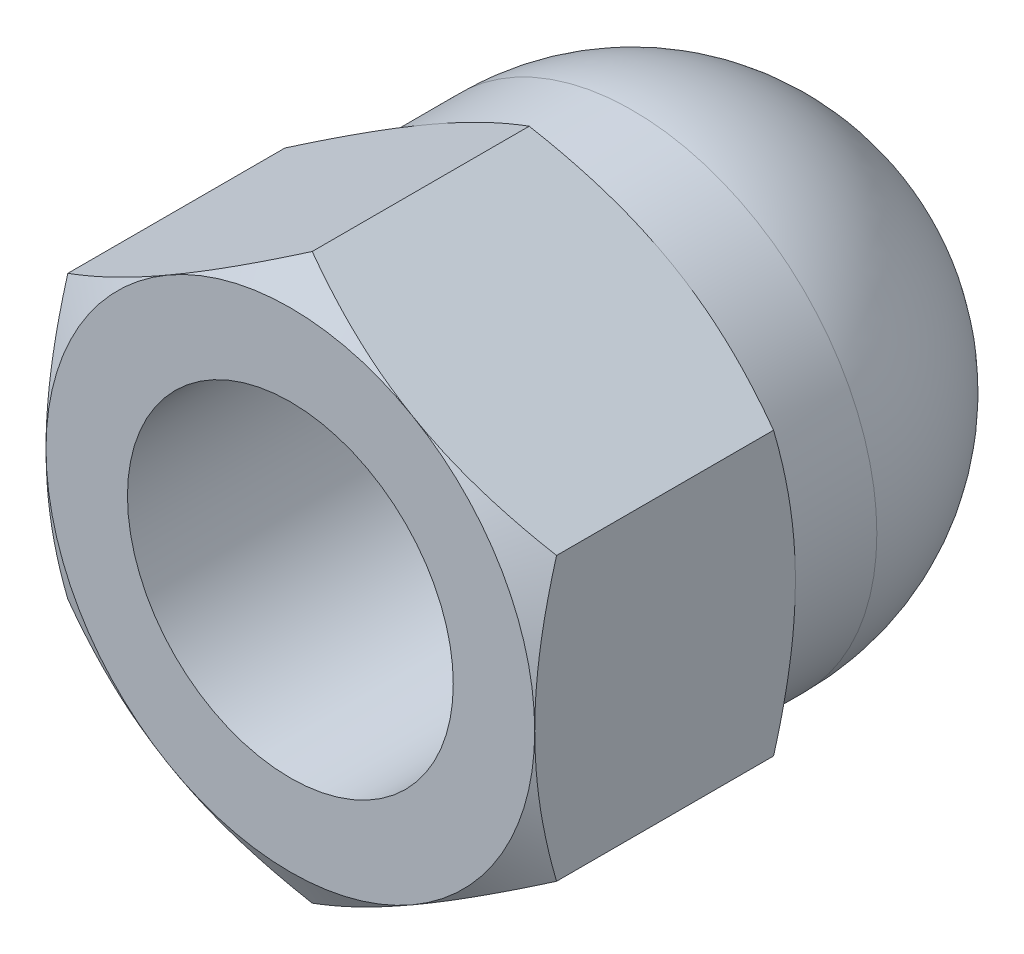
ISO-10303-21;
HEADER;
FILE_DESCRIPTION(('STEP AP214'),'2;1');
FILE_NAME('part.step','',(''),(''),'','','');
FILE_SCHEMA(('AUTOMOTIVE_DESIGN { 1 0 10303 214 1 1 1 1 }'));
ENDSEC;
DATA;
#1=APPLICATION_CONTEXT('core data for automotive mechanical design processes');
#2=APPLICATION_PROTOCOL_DEFINITION('international standard','automotive_design',2000,#1);
#3=PRODUCT_CONTEXT('',#1,'mechanical');
#4=PRODUCT('Part','Part','',(#3));
#5=PRODUCT_RELATED_PRODUCT_CATEGORY('part','',(#4));
#6=PRODUCT_DEFINITION_FORMATION('','',#4);
#7=PRODUCT_DEFINITION_CONTEXT('part definition',#1,'design');
#8=PRODUCT_DEFINITION('design','',#6,#7);
#9=PRODUCT_DEFINITION_SHAPE('','',#8);
#10=(LENGTH_UNIT() NAMED_UNIT(*) SI_UNIT(.MILLI.,.METRE.));
#11=(NAMED_UNIT(*) PLANE_ANGLE_UNIT() SI_UNIT($,.RADIAN.));
#12=(NAMED_UNIT(*) SI_UNIT($,.STERADIAN.) SOLID_ANGLE_UNIT());
#13=UNCERTAINTY_MEASURE_WITH_UNIT(LENGTH_MEASURE(1.E-05),#10,'distance_accuracy_value','');
#14=(GEOMETRIC_REPRESENTATION_CONTEXT(3) GLOBAL_UNCERTAINTY_ASSIGNED_CONTEXT((#13)) GLOBAL_UNIT_ASSIGNED_CONTEXT((#10,
#11,#12)) REPRESENTATION_CONTEXT('',''));
#15=CARTESIAN_POINT('',(0.,0.,0.));
#16=DIRECTION('',(0.,0.,1.));
#17=DIRECTION('',(1.,0.,0.));
#18=AXIS2_PLACEMENT_3D('',#15,#16,#17);
#19=CARTESIAN_POINT('',(-15.,25.9807621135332,0.));
#20=DIRECTION('',(0.,0.,-1.));
#21=DIRECTION('',(-1.,0.,0.));
#22=AXIS2_PLACEMENT_3D('',#19,#20,#21);
#23=PLANE('',#22);
#24=CARTESIAN_POINT('',(0.,0.,0.));
#25=DIRECTION('',(0.,0.,1.));
#26=DIRECTION('',(1.,0.,0.));
#27=AXIS2_PLACEMENT_3D('',#24,#25,#26);
#28=CIRCLE('',#27,10.);
#29=CARTESIAN_POINT('',(10.,0.,0.));
#30=VERTEX_POINT('',#29);
#31=EDGE_CURVE('E341',#30,#30,#28,.T.);
#32=ORIENTED_EDGE('',*,*,#31,.F.);
#33=EDGE_LOOP('',(#32));
#34=FACE_BOUND('',#33,.T.);
#35=CARTESIAN_POINT('',(0.,0.,0.));
#36=DIRECTION('',(0.,0.,-1.));
#37=DIRECTION('',(-1.,0.,0.));
#38=AXIS2_PLACEMENT_3D('',#35,#36,#37);
#39=CIRCLE('',#38,15.);
#40=CARTESIAN_POINT('',(-15.,0.,0.));
#41=VERTEX_POINT('',#40);
#42=CARTESIAN_POINT('',(-7.5,12.9903810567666,0.));
#43=VERTEX_POINT('',#42);
#44=EDGE_CURVE('E156',#41,#43,#39,.T.);
#45=ORIENTED_EDGE('',*,*,#44,.F.);
#46=CARTESIAN_POINT('',(0.,0.,0.));
#47=DIRECTION('',(0.,0.,-1.));
#48=DIRECTION('',(-1.,0.,0.));
#49=AXIS2_PLACEMENT_3D('',#46,#47,#48);
#50=CIRCLE('',#49,15.);
#51=CARTESIAN_POINT('',(-7.49999999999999,-12.9903810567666,0.));
#52=VERTEX_POINT('',#51);
#53=EDGE_CURVE('E145',#41,#52,#50,.F.);
#54=ORIENTED_EDGE('',*,*,#53,.T.);
#55=CARTESIAN_POINT('',(7.49999999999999,-12.9903810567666,0.));
#56=VERTEX_POINT('',#55);
#57=EDGE_CURVE('E261',#52,#56,#50,.F.);
#58=ORIENTED_EDGE('',*,*,#57,.T.);
#59=CARTESIAN_POINT('',(15.,0.,0.));
#60=VERTEX_POINT('',#59);
#61=EDGE_CURVE('E266',#56,#60,#50,.F.);
#62=ORIENTED_EDGE('',*,*,#61,.T.);
#63=CARTESIAN_POINT('',(7.49999999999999,12.9903810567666,0.));
#64=VERTEX_POINT('',#63);
#65=EDGE_CURVE('E267',#60,#64,#50,.F.);
#66=ORIENTED_EDGE('',*,*,#65,.T.);
#67=EDGE_CURVE('E248',#64,#43,#50,.F.);
#68=ORIENTED_EDGE('',*,*,#67,.T.);
#69=EDGE_LOOP('',(#45,#54,#58,#62,#66,#68));
#70=FACE_BOUND('',#69,.T.);
#71=ADVANCED_FACE('F32',(#34,#70),#23,.F.);
#72=CARTESIAN_POINT('',(0.,0.,0.));
#73=DIRECTION('',(0.,0.,-1.));
#74=DIRECTION('',(-1.,0.,0.));
#75=AXIS2_PLACEMENT_3D('',#72,#73,#74);
#76=CONICAL_SURFACE('',#75,15.,1.0471975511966);
#77=CARTESIAN_POINT('',(-15.,-23.3393093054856,-7.3576875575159));
#78=CARTESIAN_POINT('',(-15.,-23.0113763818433,-7.19841663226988));
#79=CARTESIAN_POINT('',(-15.,-22.6830606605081,-7.0399342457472));
#80=CARTESIAN_POINT('',(-15.,-22.0255837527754,-6.72472501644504));
#81=CARTESIAN_POINT('',(-15.,-21.6964225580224,-6.56799819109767));
#82=CARTESIAN_POINT('',(-15.,-20.7074642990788,-6.10067791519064));
#83=CARTESIAN_POINT('',(-15.,-20.0462884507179,-5.79299136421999));
#84=CARTESIAN_POINT('',(-15.,-18.7159764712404,-5.18557696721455));
#85=CARTESIAN_POINT('',(-15.,-18.0468166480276,-4.88590088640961));
#86=CARTESIAN_POINT('',(-15.,-16.7032011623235,-4.29870839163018));
#87=CARTESIAN_POINT('',(-15.,-16.0287457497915,-4.01119140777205));
#88=CARTESIAN_POINT('',(-15.,-14.651594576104,-3.44250105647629));
#89=CARTESIAN_POINT('',(-15.,-13.9486896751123,-3.16183152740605));
#90=CARTESIAN_POINT('',(-15.,-12.5346804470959,-2.621548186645));
#91=CARTESIAN_POINT('',(-15.,-11.823575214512,-2.36193672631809));
#92=CARTESIAN_POINT('',(-15.,-10.3933623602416,-1.8705311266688));
#93=CARTESIAN_POINT('',(-15.,-9.67427399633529,-1.63868138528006));
#94=CARTESIAN_POINT('',(-15.,-8.22571576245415,-1.21017371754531));
#95=CARTESIAN_POINT('',(-15.,-7.49624921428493,-1.01350479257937));
#96=CARTESIAN_POINT('',(-15.,-6.39610270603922,-0.752490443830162));
#97=CARTESIAN_POINT('',(-15.,-6.02939002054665,-0.671323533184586));
#98=CARTESIAN_POINT('',(-15.,-5.29344467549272,-0.521286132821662));
#99=CARTESIAN_POINT('',(-15.,-4.92421206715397,-0.452415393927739));
#100=CARTESIAN_POINT('',(-15.,-4.18347621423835,-0.32818133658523));
#101=CARTESIAN_POINT('',(-15.,-3.81197300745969,-0.272817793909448));
#102=CARTESIAN_POINT('',(-15.,-3.06708460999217,-0.176699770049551));
#103=CARTESIAN_POINT('',(-15.,-2.69369950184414,-0.135944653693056));
#104=CARTESIAN_POINT('',(-15.,-1.95047864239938,-0.0703683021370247));
#105=CARTESIAN_POINT('',(-15.,-1.58066088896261,-0.0453443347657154));
#106=CARTESIAN_POINT('',(-15.,-0.84029902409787,-0.0109620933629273));
#107=CARTESIAN_POINT('',(-15.,-0.469754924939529,-0.00160355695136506));
#108=CARTESIAN_POINT('',(-15.,0.271400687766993,0.00122496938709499));
#109=CARTESIAN_POINT('',(-15.,0.642012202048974,-0.0053052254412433));
#110=CARTESIAN_POINT('',(-15.,1.38262798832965,-0.0340942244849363));
#111=CARTESIAN_POINT('',(-15.,1.75263223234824,-0.0563537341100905));
#112=CARTESIAN_POINT('',(-15.,2.63937167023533,-0.128074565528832));
#113=CARTESIAN_POINT('',(-15.,3.15552506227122,-0.184859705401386));
#114=CARTESIAN_POINT('',(-15.,4.18405620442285,-0.32596655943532));
#115=CARTESIAN_POINT('',(-15.,4.69643344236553,-0.410291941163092));
#116=CARTESIAN_POINT('',(-15.,5.71689756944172,-0.603479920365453));
#117=CARTESIAN_POINT('',(-15.,6.22498092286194,-0.712361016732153));
#118=CARTESIAN_POINT('',(-15.,7.23607939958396,-0.951336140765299));
#119=CARTESIAN_POINT('',(-15.,7.73909459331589,-1.08142987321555));
#120=CARTESIAN_POINT('',(-15.,8.75152378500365,-1.36284884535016));
#121=CARTESIAN_POINT('',(-15.,9.26082088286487,-1.51459173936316));
#122=CARTESIAN_POINT('',(-15.,10.2743970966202,-1.83391678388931));
#123=CARTESIAN_POINT('',(-15.,10.7786761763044,-2.00149904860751));
#124=CARTESIAN_POINT('',(-15.,11.7824677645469,-2.34982725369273));
#125=CARTESIAN_POINT('',(-15.,12.2819817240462,-2.53056903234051));
#126=CARTESIAN_POINT('',(-15.,13.2768545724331,-2.90307352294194));
#127=CARTESIAN_POINT('',(-15.,13.7722135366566,-3.0948360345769));
#128=CARTESIAN_POINT('',(-15.,15.0436675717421,-3.60070607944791));
#129=CARTESIAN_POINT('',(-15.,15.8170452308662,-3.92163726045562));
#130=CARTESIAN_POINT('',(-15.,17.3564052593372,-4.58082775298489));
#131=CARTESIAN_POINT('',(-15.,18.1223869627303,-4.9190886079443));
#132=CARTESIAN_POINT('',(-15.,19.6485392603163,-5.60905898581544));
#133=CARTESIAN_POINT('',(-15.,20.4087079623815,-5.96077268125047));
#134=CARTESIAN_POINT('',(-15.,21.924096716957,-6.67461099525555));
#135=CARTESIAN_POINT('',(-15.,22.6793169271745,-7.03673528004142));
#136=CARTESIAN_POINT('',(-15.,24.1867764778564,-7.7697479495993));
#137=CARTESIAN_POINT('',(-15.,24.9390102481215,-8.14064776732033));
#138=CARTESIAN_POINT('',(-15.,26.4401635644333,-8.88909646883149));
#139=CARTESIAN_POINT('',(-15.,27.1890830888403,-9.26664539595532));
#140=CARTESIAN_POINT('',(-15.,28.6840389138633,-10.0270776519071));
#141=CARTESIAN_POINT('',(-15.,29.4300757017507,-10.4099600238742));
#142=CARTESIAN_POINT('',(-15.,30.9198465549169,-11.1801693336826));
#143=CARTESIAN_POINT('',(-15.,31.6635806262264,-11.567496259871));
#144=CARTESIAN_POINT('',(-15.,33.7472761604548,-12.6592216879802));
#145=CARTESIAN_POINT('',(-15.,35.0850614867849,-13.367773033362));
#146=CARTESIAN_POINT('',(-15.,37.7560146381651,-14.7936653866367));
#147=CARTESIAN_POINT('',(-15.,39.0891822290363,-15.5110068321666));
#148=CARTESIAN_POINT('',(-15.,41.7479806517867,-16.9501647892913));
#149=CARTESIAN_POINT('',(-15.,43.0736221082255,-17.671961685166));
#150=CARTESIAN_POINT('',(-15.,45.0599534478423,-18.7584424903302));
#151=CARTESIAN_POINT('',(-15.,45.7216867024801,-19.1212214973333));
#152=CARTESIAN_POINT('',(-15.,47.0445303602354,-19.8479113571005));
#153=CARTESIAN_POINT('',(-15.,47.7056407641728,-20.2118222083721));
#154=CARTESIAN_POINT('',(-15.,48.3664769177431,-20.5762305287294));
#155=B_SPLINE_CURVE_WITH_KNOTS('',3,(#77,#78,#79,#80,#81,#82,#83,#84,#85,#86,#87,#88,#89,#90,
#91,#92,#93,#94,#95,#96,#97,#98,#99,#100,#101,#102,#103,#104,#105,#106,#107,#108,#109,#110,#111,
#112,#113,#114,#115,#116,#117,#118,#119,#120,#121,#122,#123,#124,#125,#126,#127,#128,#129,#130,
#131,#132,#133,#134,#135,#136,#137,#138,#139,#140,#141,#142,#143,#144,#145,#146,#147,#148,#149,
#150,#151,#152,#153,#154),.UNSPECIFIED.,.F.,.F.,(4,2,2,2,2,2,2,2,2,2,2,2,2,2,2,2,2,2,2,2,2,2,2,
2,2,2,2,2,2,2,2,2,2,2,2,2,2,2,4),(0.,1.09369135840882,2.18739356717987,4.37511793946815,
6.57462034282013,8.77401954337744,11.0443689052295,13.3149714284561,15.5809474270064,
17.8462137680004,18.9728046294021,20.0993726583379,21.2259219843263,22.3524223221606,
23.4640902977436,24.5757396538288,25.6874019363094,26.7991140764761,28.3560578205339,
29.9132089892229,31.4715371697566,33.0298436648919,34.623802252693,36.2177723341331,
37.8112404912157,39.4046796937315,41.9163419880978,44.4282283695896,46.9409002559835,
49.4534916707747,51.9695595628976,54.4856438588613,57.0012824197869,59.5169143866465,
64.0583868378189,68.6000863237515,73.1282984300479,75.3922533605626,77.6562053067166),.UNSPECIFIED.);
#156=CARTESIAN_POINT('',(-15.,8.66025403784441,-1.3397459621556));
#157=VERTEX_POINT('',#156);
#158=EDGE_CURVE('E173',#157,#41,#155,.F.);
#159=ORIENTED_EDGE('',*,*,#158,.T.);
#160=ORIENTED_EDGE('',*,*,#44,.T.);
#161=CARTESIAN_POINT('',(0.000199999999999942,17.3206235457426,-1.33981262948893));
#162=CARTESIAN_POINT('',(-0.329494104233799,17.130274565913,-1.22992178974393));
#163=CARTESIAN_POINT('',(-0.660474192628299,16.939183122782,-1.12501758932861));
#164=CARTESIAN_POINT('',(-1.32508844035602,16.5554679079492,-0.926568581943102));
#165=CARTESIAN_POINT('',(-1.6587234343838,16.3628436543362,-0.833027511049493));
#166=CARTESIAN_POINT('',(-2.32929228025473,15.9756905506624,-0.658562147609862));
#167=CARTESIAN_POINT('',(-2.66623200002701,15.7811583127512,-0.577667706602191));
#168=CARTESIAN_POINT('',(-3.34245276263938,15.3907420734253,-0.430232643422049));
#169=CARTESIAN_POINT('',(-3.68173367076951,15.1948581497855,-0.363691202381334));
#170=CARTESIAN_POINT('',(-4.35394314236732,14.8067578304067,-0.247792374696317));
#171=CARTESIAN_POINT('',(-4.68682180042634,14.6145702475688,-0.198051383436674));
#172=CARTESIAN_POINT('',(-5.3541044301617,14.2293144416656,-0.114646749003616));
#173=CARTESIAN_POINT('',(-5.6885084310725,14.0362462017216,-0.0809834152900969));
#174=CARTESIAN_POINT('',(-6.35787818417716,13.6497853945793,-0.0305840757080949));
#175=CARTESIAN_POINT('',(-6.69284279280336,13.4563934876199,-0.0138279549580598));
#176=CARTESIAN_POINT('',(-7.36308121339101,13.0694311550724,0.00239660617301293));
#177=CARTESIAN_POINT('',(-7.69835501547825,12.8758607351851,0.00186558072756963));
#178=CARTESIAN_POINT('',(-8.32514688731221,12.5139822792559,-0.0152766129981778));
#179=CARTESIAN_POINT('',(-8.61670962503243,12.3456484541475,-0.0297968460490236));
#180=CARTESIAN_POINT('',(-9.19916443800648,12.0093680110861,-0.0716371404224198));
#181=CARTESIAN_POINT('',(-9.49005646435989,11.8414214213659,-0.0989581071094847));
#182=CARTESIAN_POINT('',(-10.0710118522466,11.5060066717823,-0.165923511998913));
#183=CARTESIAN_POINT('',(-10.3610743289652,11.338539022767,-0.20557812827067));
#184=CARTESIAN_POINT('',(-10.939839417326,11.0043888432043,-0.296515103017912));
#185=CARTESIAN_POINT('',(-11.2285419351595,10.8377063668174,-0.347798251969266));
#186=CARTESIAN_POINT('',(-12.1049144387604,10.3317324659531,-0.520386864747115));
#187=CARTESIAN_POINT('',(-12.6900465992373,9.99390625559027,-0.658901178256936));
#188=CARTESIAN_POINT('',(-13.8515859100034,9.32329122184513,-0.973271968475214));
#189=CARTESIAN_POINT('',(-14.4280079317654,8.99049381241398,-1.14905461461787));
#190=CARTESIAN_POINT('',(-15.0002,8.66013856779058,-1.33981262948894));
#191=B_SPLINE_CURVE_WITH_KNOTS('',3,(#161,#162,#163,#164,#165,#166,#167,#168,#169,#170,#171,
#172,#173,#174,#175,#176,#177,#178,#179,#180,#181,#182,#183,#184,#185,#186,#187,#188,#189,#190),
.UNSPECIFIED.,.F.,.F.,(4,2,2,2,2,2,2,2,2,2,2,2,2,2,4),(0.,1.18875411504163,2.37789802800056,
3.56980778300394,4.76164951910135,5.92407379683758,7.08652044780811,8.24758247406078,
9.40860862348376,10.4193068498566,11.4300765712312,12.4416826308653,13.4533574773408,
15.5211962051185,17.584976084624),.UNSPECIFIED.);
#192=EDGE_CURVE('E160',#43,#157,#191,.T.);
#193=ORIENTED_EDGE('',*,*,#192,.T.);
#194=EDGE_LOOP('',(#159,#160,#193));
#195=FACE_BOUND('',#194,.T.);
#196=ADVANCED_FACE('F180',(#195),#76,.T.);
#197=CARTESIAN_POINT('',(15.0002,8.66013856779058,-1.33981262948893));
#198=CARTESIAN_POINT('',(14.6705058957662,8.85048754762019,-1.22992178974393));
#199=CARTESIAN_POINT('',(14.3395258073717,9.04157899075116,-1.12501758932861));
#200=CARTESIAN_POINT('',(13.674911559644,9.42529420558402,-0.926568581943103));
#201=CARTESIAN_POINT('',(13.3412765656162,9.61791845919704,-0.833027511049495));
#202=CARTESIAN_POINT('',(12.6707077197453,10.0050715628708,-0.658562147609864));
#203=CARTESIAN_POINT('',(12.333767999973,10.199603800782,-0.577667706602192));
#204=CARTESIAN_POINT('',(11.6575472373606,10.5900200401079,-0.43023264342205));
#205=CARTESIAN_POINT('',(11.3182663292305,10.7859039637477,-0.363691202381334));
#206=CARTESIAN_POINT('',(10.6460568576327,11.1740042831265,-0.247792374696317));
#207=CARTESIAN_POINT('',(10.3131781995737,11.3661918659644,-0.198051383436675));
#208=CARTESIAN_POINT('',(9.6458955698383,11.7514476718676,-0.114646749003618));
#209=CARTESIAN_POINT('',(9.3114915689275,11.9445159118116,-0.0809834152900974));
#210=CARTESIAN_POINT('',(8.64212181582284,12.3309767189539,-0.0305840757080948));
#211=CARTESIAN_POINT('',(8.30715720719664,12.5243686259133,-0.0138279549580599));
#212=CARTESIAN_POINT('',(7.63691878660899,12.9113309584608,0.00239660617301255));
#213=CARTESIAN_POINT('',(7.30164498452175,13.1049013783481,0.00186558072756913));
#214=CARTESIAN_POINT('',(6.67485311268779,13.4667798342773,-0.0152766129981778));
#215=CARTESIAN_POINT('',(6.38329037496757,13.6351136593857,-0.029796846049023));
#216=CARTESIAN_POINT('',(5.80083556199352,13.9713941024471,-0.0716371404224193));
#217=CARTESIAN_POINT('',(5.50994353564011,14.1393406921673,-0.098958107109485));
#218=CARTESIAN_POINT('',(4.92898814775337,14.4747554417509,-0.165923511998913));
#219=CARTESIAN_POINT('',(4.63892567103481,14.6422230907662,-0.205578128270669));
#220=CARTESIAN_POINT('',(4.06016058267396,14.9763732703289,-0.29651510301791));
#221=CARTESIAN_POINT('',(3.77145806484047,15.1430557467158,-0.347798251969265));
#222=CARTESIAN_POINT('',(2.89508556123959,15.6490296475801,-0.520386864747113));
#223=CARTESIAN_POINT('',(2.30995340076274,15.9868558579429,-0.658901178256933));
#224=CARTESIAN_POINT('',(1.14841408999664,16.6574708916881,-0.97327196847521));
#225=CARTESIAN_POINT('',(0.571992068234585,16.9902683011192,-1.14905461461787));
#226=CARTESIAN_POINT('',(-0.000199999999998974,17.3206235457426,-1.33981262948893));
#227=B_SPLINE_CURVE_WITH_KNOTS('',3,(#197,#198,#199,#200,#201,#202,#203,#204,#205,#206,#207,
#208,#209,#210,#211,#212,#213,#214,#215,#216,#217,#218,#219,#220,#221,#222,#223,#224,#225,#226),
.UNSPECIFIED.,.F.,.F.,(4,2,2,2,2,2,2,2,2,2,2,2,2,2,4),(0.,1.18875411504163,2.37789802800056,
3.56980778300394,4.76164951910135,5.92407379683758,7.08652044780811,8.24758247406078,
9.40860862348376,10.4193068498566,11.4300765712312,12.4416826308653,13.4533574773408,
15.5211962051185,17.584976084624),.UNSPECIFIED.);
#228=CARTESIAN_POINT('',(0.,17.3205080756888,-1.3397459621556));
#229=VERTEX_POINT('',#228);
#230=EDGE_CURVE('E198',#64,#229,#227,.T.);
#231=ORIENTED_EDGE('',*,*,#230,.T.);
#232=EDGE_CURVE('E172',#229,#43,#191,.T.);
#233=ORIENTED_EDGE('',*,*,#232,.T.);
#234=ORIENTED_EDGE('',*,*,#67,.F.);
#235=EDGE_LOOP('',(#231,#233,#234));
#236=FACE_BOUND('',#235,.T.);
#237=ADVANCED_FACE('F185',(#236),#76,.T.);
#238=CARTESIAN_POINT('',(15.,-23.3393093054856,-7.3576875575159));
#239=CARTESIAN_POINT('',(15.,-23.0113763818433,-7.19841663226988));
#240=CARTESIAN_POINT('',(15.,-22.6830606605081,-7.0399342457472));
#241=CARTESIAN_POINT('',(15.,-22.0255837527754,-6.72472501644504));
#242=CARTESIAN_POINT('',(15.,-21.6964225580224,-6.56799819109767));
#243=CARTESIAN_POINT('',(15.,-20.7074642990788,-6.10067791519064));
#244=CARTESIAN_POINT('',(15.,-20.0462884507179,-5.79299136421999));
#245=CARTESIAN_POINT('',(15.,-18.7159764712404,-5.18557696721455));
#246=CARTESIAN_POINT('',(15.,-18.0468166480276,-4.88590088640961));
#247=CARTESIAN_POINT('',(15.,-16.7032011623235,-4.29870839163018));
#248=CARTESIAN_POINT('',(15.,-16.0287457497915,-4.01119140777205));
#249=CARTESIAN_POINT('',(15.,-14.651594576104,-3.44250105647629));
#250=CARTESIAN_POINT('',(15.,-13.9486896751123,-3.16183152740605));
#251=CARTESIAN_POINT('',(15.,-12.5346804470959,-2.621548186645));
#252=CARTESIAN_POINT('',(15.,-11.823575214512,-2.36193672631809));
#253=CARTESIAN_POINT('',(15.,-10.3933623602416,-1.8705311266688));
#254=CARTESIAN_POINT('',(15.,-9.67427399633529,-1.63868138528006));
#255=CARTESIAN_POINT('',(15.,-8.22571576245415,-1.21017371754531));
#256=CARTESIAN_POINT('',(15.,-7.49624921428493,-1.01350479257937));
#257=CARTESIAN_POINT('',(15.,-6.39610270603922,-0.752490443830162));
#258=CARTESIAN_POINT('',(15.,-6.02939002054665,-0.671323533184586));
#259=CARTESIAN_POINT('',(15.,-5.29344467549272,-0.521286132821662));
#260=CARTESIAN_POINT('',(15.,-4.92421206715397,-0.452415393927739));
#261=CARTESIAN_POINT('',(15.,-4.18347621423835,-0.32818133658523));
#262=CARTESIAN_POINT('',(15.,-3.81197300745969,-0.272817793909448));
#263=CARTESIAN_POINT('',(15.,-3.06708460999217,-0.176699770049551));
#264=CARTESIAN_POINT('',(15.,-2.69369950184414,-0.135944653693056));
#265=CARTESIAN_POINT('',(15.,-1.95047864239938,-0.0703683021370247));
#266=CARTESIAN_POINT('',(15.,-1.58066088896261,-0.0453443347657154));
#267=CARTESIAN_POINT('',(15.,-0.84029902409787,-0.0109620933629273));
#268=CARTESIAN_POINT('',(15.,-0.469754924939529,-0.00160355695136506));
#269=CARTESIAN_POINT('',(15.,0.271400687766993,0.00122496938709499));
#270=CARTESIAN_POINT('',(15.,0.642012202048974,-0.0053052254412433));
#271=CARTESIAN_POINT('',(15.,1.38262798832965,-0.0340942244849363));
#272=CARTESIAN_POINT('',(15.,1.75263223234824,-0.0563537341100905));
#273=CARTESIAN_POINT('',(15.,2.63937167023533,-0.128074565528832));
#274=CARTESIAN_POINT('',(15.,3.15552506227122,-0.184859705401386));
#275=CARTESIAN_POINT('',(15.,4.18405620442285,-0.32596655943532));
#276=CARTESIAN_POINT('',(15.,4.69643344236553,-0.410291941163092));
#277=CARTESIAN_POINT('',(15.,5.71689756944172,-0.603479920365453));
#278=CARTESIAN_POINT('',(15.,6.22498092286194,-0.712361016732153));
#279=CARTESIAN_POINT('',(15.,7.23607939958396,-0.951336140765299));
#280=CARTESIAN_POINT('',(15.,7.73909459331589,-1.08142987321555));
#281=CARTESIAN_POINT('',(15.,8.75152378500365,-1.36284884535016));
#282=CARTESIAN_POINT('',(15.,9.26082088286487,-1.51459173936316));
#283=CARTESIAN_POINT('',(15.,10.2743970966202,-1.83391678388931));
#284=CARTESIAN_POINT('',(15.,10.7786761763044,-2.00149904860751));
#285=CARTESIAN_POINT('',(15.,11.7824677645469,-2.34982725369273));
#286=CARTESIAN_POINT('',(15.,12.2819817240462,-2.53056903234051));
#287=CARTESIAN_POINT('',(15.,13.2768545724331,-2.90307352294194));
#288=CARTESIAN_POINT('',(15.,13.7722135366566,-3.0948360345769));
#289=CARTESIAN_POINT('',(15.,15.0436675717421,-3.60070607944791));
#290=CARTESIAN_POINT('',(15.,15.8170452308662,-3.92163726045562));
#291=CARTESIAN_POINT('',(15.,17.3564052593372,-4.58082775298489));
#292=CARTESIAN_POINT('',(15.,18.1223869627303,-4.9190886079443));
#293=CARTESIAN_POINT('',(15.,19.6485392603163,-5.60905898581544));
#294=CARTESIAN_POINT('',(15.,20.4087079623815,-5.96077268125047));
#295=CARTESIAN_POINT('',(15.,21.924096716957,-6.67461099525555));
#296=CARTESIAN_POINT('',(15.,22.6793169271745,-7.03673528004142));
#297=CARTESIAN_POINT('',(15.,24.1867764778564,-7.7697479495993));
#298=CARTESIAN_POINT('',(15.,24.9390102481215,-8.14064776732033));
#299=CARTESIAN_POINT('',(15.,26.4401635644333,-8.88909646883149));
#300=CARTESIAN_POINT('',(15.,27.1890830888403,-9.26664539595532));
#301=CARTESIAN_POINT('',(15.,28.6840389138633,-10.0270776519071));
#302=CARTESIAN_POINT('',(15.,29.4300757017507,-10.4099600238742));
#303=CARTESIAN_POINT('',(15.,30.9198465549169,-11.1801693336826));
#304=CARTESIAN_POINT('',(15.,31.6635806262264,-11.567496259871));
#305=CARTESIAN_POINT('',(15.,33.7472761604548,-12.6592216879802));
#306=CARTESIAN_POINT('',(15.,35.0850614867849,-13.367773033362));
#307=CARTESIAN_POINT('',(15.,37.7560146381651,-14.7936653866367));
#308=CARTESIAN_POINT('',(15.,39.0891822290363,-15.5110068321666));
#309=CARTESIAN_POINT('',(15.,41.7479806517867,-16.9501647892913));
#310=CARTESIAN_POINT('',(15.,43.0736221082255,-17.671961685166));
#311=CARTESIAN_POINT('',(15.,45.0599534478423,-18.7584424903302));
#312=CARTESIAN_POINT('',(15.,45.7216867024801,-19.1212214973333));
#313=CARTESIAN_POINT('',(15.,47.0445303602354,-19.8479113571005));
#314=CARTESIAN_POINT('',(15.,47.7056407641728,-20.2118222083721));
#315=CARTESIAN_POINT('',(15.,48.3664769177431,-20.5762305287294));
#316=B_SPLINE_CURVE_WITH_KNOTS('',3,(#238,#239,#240,#241,#242,#243,#244,#245,#246,#247,#248,
#249,#250,#251,#252,#253,#254,#255,#256,#257,#258,#259,#260,#261,#262,#263,#264,#265,#266,#267,
#268,#269,#270,#271,#272,#273,#274,#275,#276,#277,#278,#279,#280,#281,#282,#283,#284,#285,#286,
#287,#288,#289,#290,#291,#292,#293,#294,#295,#296,#297,#298,#299,#300,#301,#302,#303,#304,#305,
#306,#307,#308,#309,#310,#311,#312,#313,#314,#315),.UNSPECIFIED.,.F.,.F.,(4,2,2,2,2,2,2,2,2,2,2,
2,2,2,2,2,2,2,2,2,2,2,2,2,2,2,2,2,2,2,2,2,2,2,2,2,2,2,4),(0.,1.09369135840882,2.18739356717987,
4.37511793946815,6.57462034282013,8.77401954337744,11.0443689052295,13.3149714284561,
15.5809474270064,17.8462137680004,18.9728046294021,20.0993726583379,21.2259219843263,
22.3524223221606,23.4640902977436,24.5757396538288,25.6874019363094,26.7991140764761,
28.3560578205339,29.9132089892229,31.4715371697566,33.0298436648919,34.623802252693,
36.2177723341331,37.8112404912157,39.4046796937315,41.9163419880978,44.4282283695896,
46.9409002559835,49.4534916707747,51.9695595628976,54.4856438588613,57.0012824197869,
59.5169143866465,64.0583868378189,68.6000863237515,73.1282984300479,75.3922533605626,
77.6562053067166),.UNSPECIFIED.);
#317=CARTESIAN_POINT('',(15.,8.66025403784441,-1.3397459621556));
#318=VERTEX_POINT('',#317);
#319=EDGE_CURVE('E209',#60,#318,#316,.T.);
#320=ORIENTED_EDGE('',*,*,#319,.T.);
#321=EDGE_CURVE('E285',#318,#64,#227,.T.);
#322=ORIENTED_EDGE('',*,*,#321,.T.);
#323=ORIENTED_EDGE('',*,*,#65,.F.);
#324=EDGE_LOOP('',(#320,#322,#323));
#325=FACE_BOUND('',#324,.T.);
#326=ADVANCED_FACE('F284',(#325),#76,.T.);
#327=CARTESIAN_POINT('',(-0.000199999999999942,-17.3206235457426,-1.33981262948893));
#328=CARTESIAN_POINT('',(0.329494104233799,-17.130274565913,-1.22992178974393));
#329=CARTESIAN_POINT('',(0.660474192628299,-16.939183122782,-1.12501758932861));
#330=CARTESIAN_POINT('',(1.32508844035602,-16.5554679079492,-0.926568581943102));
#331=CARTESIAN_POINT('',(1.6587234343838,-16.3628436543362,-0.833027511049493));
#332=CARTESIAN_POINT('',(2.32929228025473,-15.9756905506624,-0.658562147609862));
#333=CARTESIAN_POINT('',(2.66623200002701,-15.7811583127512,-0.577667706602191));
#334=CARTESIAN_POINT('',(3.34245276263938,-15.3907420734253,-0.430232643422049));
#335=CARTESIAN_POINT('',(3.68173367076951,-15.1948581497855,-0.363691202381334));
#336=CARTESIAN_POINT('',(4.35394314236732,-14.8067578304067,-0.247792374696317));
#337=CARTESIAN_POINT('',(4.68682180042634,-14.6145702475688,-0.198051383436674));
#338=CARTESIAN_POINT('',(5.3541044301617,-14.2293144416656,-0.114646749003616));
#339=CARTESIAN_POINT('',(5.6885084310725,-14.0362462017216,-0.0809834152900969));
#340=CARTESIAN_POINT('',(6.35787818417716,-13.6497853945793,-0.0305840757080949));
#341=CARTESIAN_POINT('',(6.69284279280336,-13.4563934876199,-0.0138279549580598));
#342=CARTESIAN_POINT('',(7.36308121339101,-13.0694311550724,0.00239660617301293));
#343=CARTESIAN_POINT('',(7.69835501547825,-12.8758607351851,0.00186558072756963));
#344=CARTESIAN_POINT('',(8.32514688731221,-12.5139822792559,-0.0152766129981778));
#345=CARTESIAN_POINT('',(8.61670962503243,-12.3456484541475,-0.0297968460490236));
#346=CARTESIAN_POINT('',(9.19916443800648,-12.0093680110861,-0.0716371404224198));
#347=CARTESIAN_POINT('',(9.49005646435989,-11.8414214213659,-0.0989581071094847));
#348=CARTESIAN_POINT('',(10.0710118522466,-11.5060066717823,-0.165923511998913));
#349=CARTESIAN_POINT('',(10.3610743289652,-11.338539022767,-0.20557812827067));
#350=CARTESIAN_POINT('',(10.939839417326,-11.0043888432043,-0.296515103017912));
#351=CARTESIAN_POINT('',(11.2285419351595,-10.8377063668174,-0.347798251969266));
#352=CARTESIAN_POINT('',(12.1049144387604,-10.3317324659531,-0.520386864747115));
#353=CARTESIAN_POINT('',(12.6900465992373,-9.99390625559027,-0.658901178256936));
#354=CARTESIAN_POINT('',(13.8515859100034,-9.32329122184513,-0.973271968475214));
#355=CARTESIAN_POINT('',(14.4280079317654,-8.99049381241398,-1.14905461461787));
#356=CARTESIAN_POINT('',(15.0002,-8.66013856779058,-1.33981262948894));
#357=B_SPLINE_CURVE_WITH_KNOTS('',3,(#327,#328,#329,#330,#331,#332,#333,#334,#335,#336,#337,
#338,#339,#340,#341,#342,#343,#344,#345,#346,#347,#348,#349,#350,#351,#352,#353,#354,#355,#356),
.UNSPECIFIED.,.F.,.F.,(4,2,2,2,2,2,2,2,2,2,2,2,2,2,4),(0.,1.18875411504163,2.37789802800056,
3.56980778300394,4.76164951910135,5.92407379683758,7.08652044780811,8.24758247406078,
9.40860862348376,10.4193068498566,11.4300765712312,12.4416826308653,13.4533574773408,
15.5211962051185,17.584976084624),.UNSPECIFIED.);
#358=CARTESIAN_POINT('',(15.,-8.66025403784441,-1.33974596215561));
#359=VERTEX_POINT('',#358);
#360=EDGE_CURVE('E215',#56,#359,#357,.T.);
#361=ORIENTED_EDGE('',*,*,#360,.T.);
#362=EDGE_CURVE('E214',#359,#60,#316,.T.);
#363=ORIENTED_EDGE('',*,*,#362,.T.);
#364=ORIENTED_EDGE('',*,*,#61,.F.);
#365=EDGE_LOOP('',(#361,#363,#364));
#366=FACE_BOUND('',#365,.T.);
#367=ADVANCED_FACE('F308',(#366),#76,.T.);
#368=CARTESIAN_POINT('',(0.,-17.3205080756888,-1.3397459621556));
#369=VERTEX_POINT('',#368);
#370=EDGE_CURVE('E135',#369,#56,#357,.T.);
#371=ORIENTED_EDGE('',*,*,#370,.T.);
#372=ORIENTED_EDGE('',*,*,#57,.F.);
#373=CARTESIAN_POINT('',(-15.0002,-8.66013856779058,-1.33981262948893));
#374=CARTESIAN_POINT('',(-14.6705058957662,-8.85048754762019,-1.22992178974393));
#375=CARTESIAN_POINT('',(-14.3395258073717,-9.04157899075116,-1.12501758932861));
#376=CARTESIAN_POINT('',(-13.674911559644,-9.42529420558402,-0.926568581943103));
#377=CARTESIAN_POINT('',(-13.3412765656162,-9.61791845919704,-0.833027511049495));
#378=CARTESIAN_POINT('',(-12.6707077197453,-10.0050715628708,-0.658562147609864));
#379=CARTESIAN_POINT('',(-12.333767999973,-10.199603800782,-0.577667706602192));
#380=CARTESIAN_POINT('',(-11.6575472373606,-10.5900200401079,-0.43023264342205));
#381=CARTESIAN_POINT('',(-11.3182663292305,-10.7859039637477,-0.363691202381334));
#382=CARTESIAN_POINT('',(-10.6460568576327,-11.1740042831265,-0.247792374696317));
#383=CARTESIAN_POINT('',(-10.3131781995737,-11.3661918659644,-0.198051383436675));
#384=CARTESIAN_POINT('',(-9.6458955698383,-11.7514476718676,-0.114646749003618));
#385=CARTESIAN_POINT('',(-9.3114915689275,-11.9445159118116,-0.0809834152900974));
#386=CARTESIAN_POINT('',(-8.64212181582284,-12.3309767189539,-0.0305840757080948));
#387=CARTESIAN_POINT('',(-8.30715720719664,-12.5243686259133,-0.0138279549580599));
#388=CARTESIAN_POINT('',(-7.63691878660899,-12.9113309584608,0.00239660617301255));
#389=CARTESIAN_POINT('',(-7.30164498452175,-13.1049013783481,0.00186558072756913));
#390=CARTESIAN_POINT('',(-6.67485311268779,-13.4667798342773,-0.0152766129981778));
#391=CARTESIAN_POINT('',(-6.38329037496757,-13.6351136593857,-0.029796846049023));
#392=CARTESIAN_POINT('',(-5.80083556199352,-13.9713941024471,-0.0716371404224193));
#393=CARTESIAN_POINT('',(-5.50994353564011,-14.1393406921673,-0.098958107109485));
#394=CARTESIAN_POINT('',(-4.92898814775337,-14.4747554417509,-0.165923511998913));
#395=CARTESIAN_POINT('',(-4.63892567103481,-14.6422230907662,-0.205578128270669));
#396=CARTESIAN_POINT('',(-4.06016058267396,-14.9763732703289,-0.29651510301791));
#397=CARTESIAN_POINT('',(-3.77145806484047,-15.1430557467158,-0.347798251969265));
#398=CARTESIAN_POINT('',(-2.89508556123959,-15.6490296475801,-0.520386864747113));
#399=CARTESIAN_POINT('',(-2.30995340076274,-15.9868558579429,-0.658901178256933));
#400=CARTESIAN_POINT('',(-1.14841408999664,-16.6574708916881,-0.97327196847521));
#401=CARTESIAN_POINT('',(-0.571992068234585,-16.9902683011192,-1.14905461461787));
#402=CARTESIAN_POINT('',(0.000199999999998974,-17.3206235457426,-1.33981262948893));
#403=B_SPLINE_CURVE_WITH_KNOTS('',3,(#373,#374,#375,#376,#377,#378,#379,#380,#381,#382,#383,
#384,#385,#386,#387,#388,#389,#390,#391,#392,#393,#394,#395,#396,#397,#398,#399,#400,#401,#402),
.UNSPECIFIED.,.F.,.F.,(4,2,2,2,2,2,2,2,2,2,2,2,2,2,4),(0.,1.18875411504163,2.37789802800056,
3.56980778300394,4.76164951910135,5.92407379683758,7.08652044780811,8.24758247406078,
9.40860862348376,10.4193068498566,11.4300765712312,12.4416826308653,13.4533574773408,
15.5211962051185,17.584976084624),.UNSPECIFIED.);
#404=EDGE_CURVE('E305',#52,#369,#403,.T.);
#405=ORIENTED_EDGE('',*,*,#404,.T.);
#406=EDGE_LOOP('',(#371,#372,#405));
#407=FACE_BOUND('',#406,.T.);
#408=ADVANCED_FACE('F187',(#407),#76,.T.);
#409=CARTESIAN_POINT('',(-15.,-8.66025403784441,-1.33974596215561));
#410=VERTEX_POINT('',#409);
#411=EDGE_CURVE('E203',#410,#52,#403,.T.);
#412=ORIENTED_EDGE('',*,*,#411,.T.);
#413=ORIENTED_EDGE('',*,*,#53,.F.);
#414=EDGE_CURVE('E288',#41,#410,#155,.F.);
#415=ORIENTED_EDGE('',*,*,#414,.T.);
#416=EDGE_LOOP('',(#412,#413,#415));
#417=FACE_BOUND('',#416,.T.);
#418=ADVANCED_FACE('F301',(#417),#76,.T.);
#419=CARTESIAN_POINT('',(15.,8.66025403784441,-16.));
#420=DIRECTION('',(0.499999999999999,0.866025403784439,0.));
#421=DIRECTION('',(-0.866025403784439,0.499999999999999,0.));
#422=AXIS2_PLACEMENT_3D('',#419,#420,#421);
#423=PLANE('',#422);
#424=CARTESIAN_POINT('',(-0.0002,17.3206235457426,-14.6601873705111));
#425=CARTESIAN_POINT('',(0.329494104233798,17.130274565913,-14.7700782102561));
#426=CARTESIAN_POINT('',(0.660474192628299,16.939183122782,-14.8749824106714));
#427=CARTESIAN_POINT('',(1.32508844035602,16.5554679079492,-15.0734314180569));
#428=CARTESIAN_POINT('',(1.6587234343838,16.3628436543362,-15.1669724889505));
#429=CARTESIAN_POINT('',(2.32929228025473,15.9756905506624,-15.3414378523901));
#430=CARTESIAN_POINT('',(2.66623200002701,15.7811583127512,-15.4223322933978));
#431=CARTESIAN_POINT('',(3.34245276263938,15.3907420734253,-15.569767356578));
#432=CARTESIAN_POINT('',(3.68173367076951,15.1948581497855,-15.6363087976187));
#433=CARTESIAN_POINT('',(4.35394314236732,14.8067578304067,-15.7522076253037));
#434=CARTESIAN_POINT('',(4.68682180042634,14.6145702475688,-15.8019486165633));
#435=CARTESIAN_POINT('',(5.3541044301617,14.2293144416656,-15.8853532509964));
#436=CARTESIAN_POINT('',(5.6885084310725,14.0362462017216,-15.9190165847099));
#437=CARTESIAN_POINT('',(6.35787818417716,13.6497853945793,-15.9694159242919));
#438=CARTESIAN_POINT('',(6.69284279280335,13.4563934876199,-15.9861720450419));
#439=CARTESIAN_POINT('',(7.36308121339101,13.0694311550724,-16.002396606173));
#440=CARTESIAN_POINT('',(7.69835501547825,12.8758607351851,-16.0018655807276));
#441=CARTESIAN_POINT('',(8.32514688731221,12.5139822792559,-15.9847233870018));
#442=CARTESIAN_POINT('',(8.61670962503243,12.3456484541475,-15.970203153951));
#443=CARTESIAN_POINT('',(9.19916443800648,12.0093680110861,-15.9283628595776));
#444=CARTESIAN_POINT('',(9.49005646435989,11.8414214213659,-15.9010418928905));
#445=CARTESIAN_POINT('',(10.0710118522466,11.5060066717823,-15.8340764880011));
#446=CARTESIAN_POINT('',(10.3610743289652,11.338539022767,-15.7944218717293));
#447=CARTESIAN_POINT('',(10.939839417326,11.0043888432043,-15.7034848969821));
#448=CARTESIAN_POINT('',(11.2285419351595,10.8377063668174,-15.6522017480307));
#449=CARTESIAN_POINT('',(12.1049144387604,10.3317324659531,-15.4796131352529));
#450=CARTESIAN_POINT('',(12.6900465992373,9.99390625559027,-15.3410988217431));
#451=CARTESIAN_POINT('',(13.8515859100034,9.32329122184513,-15.0267280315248));
#452=CARTESIAN_POINT('',(14.4280079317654,8.99049381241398,-14.8509453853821));
#453=CARTESIAN_POINT('',(15.0002,8.66013856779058,-14.6601873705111));
#454=B_SPLINE_CURVE_WITH_KNOTS('',3,(#424,#425,#426,#427,#428,#429,#430,#431,#432,#433,#434,
#435,#436,#437,#438,#439,#440,#441,#442,#443,#444,#445,#446,#447,#448,#449,#450,#451,#452,#453),
.UNSPECIFIED.,.F.,.F.,(4,2,2,2,2,2,2,2,2,2,2,2,2,2,4),(0.,1.18875411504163,2.37789802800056,
3.56980778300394,4.76164951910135,5.92407379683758,7.08652044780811,8.24758247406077,
9.40860862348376,10.4193068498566,11.4300765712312,12.4416826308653,13.4533574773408,
15.5211962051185,17.5849760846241),.UNSPECIFIED.);
#455=CARTESIAN_POINT('',(0.,17.3205080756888,-14.6602540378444));
#456=VERTEX_POINT('',#455);
#457=CARTESIAN_POINT('',(7.49999999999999,12.9903810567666,-16.));
#458=VERTEX_POINT('',#457);
#459=EDGE_CURVE('E139',#456,#458,#454,.T.);
#460=ORIENTED_EDGE('',*,*,#459,.F.);
#461=DIRECTION('',(0.,0.,1.));
#462=VECTOR('',#461,1.);
#463=CARTESIAN_POINT('',(0.,17.3205080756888,-16.));
#464=LINE('',#463,#462);
#465=EDGE_CURVE('E132',#456,#229,#464,.T.);
#466=ORIENTED_EDGE('',*,*,#465,.T.);
#467=ORIENTED_EDGE('',*,*,#230,.F.);
#468=ORIENTED_EDGE('',*,*,#321,.F.);
#469=DIRECTION('',(0.,0.,1.));
#470=VECTOR('',#469,1.);
#471=CARTESIAN_POINT('',(15.,8.66025403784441,-16.));
#472=LINE('',#471,#470);
#473=CARTESIAN_POINT('',(15.,8.66025403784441,-14.6602540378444));
#474=VERTEX_POINT('',#473);
#475=EDGE_CURVE('E245',#474,#318,#472,.T.);
#476=ORIENTED_EDGE('',*,*,#475,.F.);
#477=EDGE_CURVE('E240',#458,#474,#454,.T.);
#478=ORIENTED_EDGE('',*,*,#477,.F.);
#479=EDGE_LOOP('',(#460,#466,#467,#468,#476,#478));
#480=FACE_BOUND('',#479,.T.);
#481=ADVANCED_FACE('F34',(#480),#423,.T.);
#482=CARTESIAN_POINT('',(15.,-8.66025403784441,-16.));
#483=DIRECTION('',(1.,0.,0.));
#484=DIRECTION('',(0.,0.,-1.));
#485=AXIS2_PLACEMENT_3D('',#482,#483,#484);
#486=PLANE('',#485);
#487=CARTESIAN_POINT('',(15.,-23.3393093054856,-8.6423124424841));
#488=CARTESIAN_POINT('',(15.,-23.0113763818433,-8.80158336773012));
#489=CARTESIAN_POINT('',(15.,-22.6830606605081,-8.9600657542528));
#490=CARTESIAN_POINT('',(15.,-22.0255837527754,-9.27527498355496));
#491=CARTESIAN_POINT('',(15.,-21.6964225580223,-9.43200180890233));
#492=CARTESIAN_POINT('',(15.,-20.7074642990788,-9.89932208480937));
#493=CARTESIAN_POINT('',(15.,-20.0462884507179,-10.20700863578));
#494=CARTESIAN_POINT('',(15.,-18.7159764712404,-10.8144230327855));
#495=CARTESIAN_POINT('',(15.,-18.0468166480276,-11.1140991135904));
#496=CARTESIAN_POINT('',(15.,-16.7032011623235,-11.7012916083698));
#497=CARTESIAN_POINT('',(15.,-16.0287457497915,-11.988808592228));
#498=CARTESIAN_POINT('',(15.,-14.651594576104,-12.5574989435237));
#499=CARTESIAN_POINT('',(15.,-13.9486896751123,-12.838168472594));
#500=CARTESIAN_POINT('',(15.,-12.5346804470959,-13.378451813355));
#501=CARTESIAN_POINT('',(15.,-11.823575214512,-13.6380632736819));
#502=CARTESIAN_POINT('',(15.,-10.3933623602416,-14.1294688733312));
#503=CARTESIAN_POINT('',(15.,-9.67427399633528,-14.3613186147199));
#504=CARTESIAN_POINT('',(15.,-8.22571576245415,-14.7898262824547));
#505=CARTESIAN_POINT('',(15.,-7.49624921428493,-14.9864952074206));
#506=CARTESIAN_POINT('',(15.,-6.39610270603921,-15.2475095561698));
#507=CARTESIAN_POINT('',(15.,-6.02939002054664,-15.3286764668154));
#508=CARTESIAN_POINT('',(15.,-5.29344467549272,-15.4787138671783));
#509=CARTESIAN_POINT('',(15.,-4.92421206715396,-15.5475846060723));
#510=CARTESIAN_POINT('',(15.,-4.18347621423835,-15.6718186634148));
#511=CARTESIAN_POINT('',(15.,-3.81197300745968,-15.7271822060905));
#512=CARTESIAN_POINT('',(15.,-3.06708460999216,-15.8233002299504));
#513=CARTESIAN_POINT('',(15.,-2.69369950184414,-15.8640553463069));
#514=CARTESIAN_POINT('',(15.,-1.95047864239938,-15.929631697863));
#515=CARTESIAN_POINT('',(15.,-1.58066088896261,-15.9546556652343));
#516=CARTESIAN_POINT('',(15.,-0.84029902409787,-15.9890379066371));
#517=CARTESIAN_POINT('',(15.,-0.469754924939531,-15.9983964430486));
#518=CARTESIAN_POINT('',(15.,0.271400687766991,-16.0012249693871));
#519=CARTESIAN_POINT('',(15.,0.642012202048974,-15.9946947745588));
#520=CARTESIAN_POINT('',(15.,1.38262798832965,-15.9659057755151));
#521=CARTESIAN_POINT('',(15.,1.75263223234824,-15.9436462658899));
#522=CARTESIAN_POINT('',(15.,2.63937167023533,-15.8719254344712));
#523=CARTESIAN_POINT('',(15.,3.15552506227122,-15.8151402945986));
#524=CARTESIAN_POINT('',(15.,4.18405620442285,-15.6740334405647));
#525=CARTESIAN_POINT('',(15.,4.69643344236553,-15.5897080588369));
#526=CARTESIAN_POINT('',(15.,5.71689756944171,-15.3965200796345));
#527=CARTESIAN_POINT('',(15.,6.22498092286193,-15.2876389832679));
#528=CARTESIAN_POINT('',(15.,7.23607939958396,-15.0486638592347));
#529=CARTESIAN_POINT('',(15.,7.73909459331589,-14.9185701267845));
#530=CARTESIAN_POINT('',(15.,8.75152378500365,-14.6371511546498));
#531=CARTESIAN_POINT('',(15.,9.26082088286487,-14.4854082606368));
#532=CARTESIAN_POINT('',(15.,10.2743970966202,-14.1660832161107));
#533=CARTESIAN_POINT('',(15.,10.7786761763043,-13.9985009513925));
#534=CARTESIAN_POINT('',(15.,11.7824677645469,-13.6501727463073));
#535=CARTESIAN_POINT('',(15.,12.2819817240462,-13.4694309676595));
#536=CARTESIAN_POINT('',(15.,13.2768545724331,-13.0969264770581));
#537=CARTESIAN_POINT('',(15.,13.7722135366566,-12.9051639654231));
#538=CARTESIAN_POINT('',(15.,15.0436675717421,-12.3992939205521));
#539=CARTESIAN_POINT('',(15.,15.8170452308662,-12.0783627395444));
#540=CARTESIAN_POINT('',(15.,17.3564052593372,-11.4191722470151));
#541=CARTESIAN_POINT('',(15.,18.1223869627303,-11.0809113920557));
#542=CARTESIAN_POINT('',(15.,19.6485392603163,-10.3909410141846));
#543=CARTESIAN_POINT('',(15.,20.4087079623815,-10.0392273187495));
#544=CARTESIAN_POINT('',(15.,21.924096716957,-9.32538900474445));
#545=CARTESIAN_POINT('',(15.,22.6793169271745,-8.96326471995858));
#546=CARTESIAN_POINT('',(15.,24.1867764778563,-8.23025205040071));
#547=CARTESIAN_POINT('',(15.,24.9390102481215,-7.85935223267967));
#548=CARTESIAN_POINT('',(15.,26.4401635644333,-7.11090353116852));
#549=CARTESIAN_POINT('',(15.,27.1890830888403,-6.73335460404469));
#550=CARTESIAN_POINT('',(15.,28.6840389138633,-5.97292234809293));
#551=CARTESIAN_POINT('',(15.,29.4300757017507,-5.59003997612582));
#552=CARTESIAN_POINT('',(15.,30.9198465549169,-4.81983066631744));
#553=CARTESIAN_POINT('',(15.,31.6635806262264,-4.43250374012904));
#554=CARTESIAN_POINT('',(15.,33.7472761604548,-3.34077831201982));
#555=CARTESIAN_POINT('',(15.,35.0850614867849,-2.632226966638));
#556=CARTESIAN_POINT('',(15.,37.7560146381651,-1.20633461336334));
#557=CARTESIAN_POINT('',(15.,39.0891822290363,-0.488993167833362));
#558=CARTESIAN_POINT('',(15.,41.7479806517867,0.950164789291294));
#559=CARTESIAN_POINT('',(15.,43.0736221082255,1.67196168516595));
#560=CARTESIAN_POINT('',(15.,45.0599534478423,2.75844249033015));
#561=CARTESIAN_POINT('',(15.,45.7216867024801,3.12122149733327));
#562=CARTESIAN_POINT('',(15.,47.0445303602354,3.84791135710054));
#563=CARTESIAN_POINT('',(15.,47.7056407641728,4.21182220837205));
#564=CARTESIAN_POINT('',(15.,48.3664769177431,4.57623052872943));
#565=B_SPLINE_CURVE_WITH_KNOTS('',3,(#487,#488,#489,#490,#491,#492,#493,#494,#495,#496,#497,
#498,#499,#500,#501,#502,#503,#504,#505,#506,#507,#508,#509,#510,#511,#512,#513,#514,#515,#516,
#517,#518,#519,#520,#521,#522,#523,#524,#525,#526,#527,#528,#529,#530,#531,#532,#533,#534,#535,
#536,#537,#538,#539,#540,#541,#542,#543,#544,#545,#546,#547,#548,#549,#550,#551,#552,#553,#554,
#555,#556,#557,#558,#559,#560,#561,#562,#563,#564),.UNSPECIFIED.,.F.,.F.,(4,2,2,2,2,2,2,2,2,2,2,
2,2,2,2,2,2,2,2,2,2,2,2,2,2,2,2,2,2,2,2,2,2,2,2,2,2,2,4),(0.,1.09369135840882,2.18739356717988,
4.37511793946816,6.57462034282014,8.77401954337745,11.0443689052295,13.3149714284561,
15.5809474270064,17.8462137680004,18.9728046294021,20.0993726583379,21.2259219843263,
22.3524223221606,23.4640902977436,24.5757396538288,25.6874019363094,26.7991140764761,
28.3560578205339,29.9132089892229,31.4715371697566,33.0298436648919,34.623802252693,
36.2177723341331,37.8112404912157,39.4046796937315,41.9163419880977,44.4282283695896,
46.9409002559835,49.4534916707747,51.9695595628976,54.4856438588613,57.0012824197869,
59.5169143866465,64.0583868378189,68.6000863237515,73.1282984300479,75.3922533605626,
77.6562053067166),.UNSPECIFIED.);
#566=CARTESIAN_POINT('',(15.,0.,-16.));
#567=VERTEX_POINT('',#566);
#568=EDGE_CURVE('E234',#474,#567,#565,.F.);
#569=ORIENTED_EDGE('',*,*,#568,.F.);
#570=ORIENTED_EDGE('',*,*,#475,.T.);
#571=ORIENTED_EDGE('',*,*,#319,.F.);
#572=ORIENTED_EDGE('',*,*,#362,.F.);
#573=DIRECTION('',(0.,0.,1.));
#574=VECTOR('',#573,1.);
#575=CARTESIAN_POINT('',(15.,-8.66025403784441,-16.));
#576=LINE('',#575,#574);
#577=CARTESIAN_POINT('',(15.,-8.66025403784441,-14.6602540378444));
#578=VERTEX_POINT('',#577);
#579=EDGE_CURVE('E249',#578,#359,#576,.T.);
#580=ORIENTED_EDGE('',*,*,#579,.F.);
#581=EDGE_CURVE('E228',#567,#578,#565,.F.);
#582=ORIENTED_EDGE('',*,*,#581,.F.);
#583=EDGE_LOOP('',(#569,#570,#571,#572,#580,#582));
#584=FACE_BOUND('',#583,.T.);
#585=ADVANCED_FACE('F220',(#584),#486,.T.);
#586=CARTESIAN_POINT('',(15.,-8.66025403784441,-16.));
#587=DIRECTION('',(0.499999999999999,-0.866025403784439,0.));
#588=DIRECTION('',(0.866025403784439,0.499999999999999,0.));
#589=AXIS2_PLACEMENT_3D('',#586,#587,#588);
#590=PLANE('',#589);
#591=CARTESIAN_POINT('',(15.0002,-8.66013856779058,-14.6601873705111));
#592=CARTESIAN_POINT('',(14.6705058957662,-8.85048754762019,-14.7700782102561));
#593=CARTESIAN_POINT('',(14.3395258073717,-9.04157899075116,-14.8749824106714));
#594=CARTESIAN_POINT('',(13.674911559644,-9.42529420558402,-15.0734314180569));
#595=CARTESIAN_POINT('',(13.3412765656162,-9.61791845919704,-15.1669724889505));
#596=CARTESIAN_POINT('',(12.6707077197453,-10.0050715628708,-15.3414378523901));
#597=CARTESIAN_POINT('',(12.333767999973,-10.199603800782,-15.4223322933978));
#598=CARTESIAN_POINT('',(11.6575472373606,-10.5900200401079,-15.5697673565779));
#599=CARTESIAN_POINT('',(11.3182663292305,-10.7859039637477,-15.6363087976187));
#600=CARTESIAN_POINT('',(10.6460568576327,-11.1740042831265,-15.7522076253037));
#601=CARTESIAN_POINT('',(10.3131781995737,-11.3661918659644,-15.8019486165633));
#602=CARTESIAN_POINT('',(9.6458955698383,-11.7514476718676,-15.8853532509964));
#603=CARTESIAN_POINT('',(9.3114915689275,-11.9445159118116,-15.9190165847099));
#604=CARTESIAN_POINT('',(8.64212181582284,-12.3309767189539,-15.9694159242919));
#605=CARTESIAN_POINT('',(8.30715720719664,-12.5243686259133,-15.9861720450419));
#606=CARTESIAN_POINT('',(7.63691878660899,-12.9113309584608,-16.002396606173));
#607=CARTESIAN_POINT('',(7.30164498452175,-13.1049013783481,-16.0018655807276));
#608=CARTESIAN_POINT('',(6.67485311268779,-13.4667798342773,-15.9847233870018));
#609=CARTESIAN_POINT('',(6.38329037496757,-13.6351136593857,-15.970203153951));
#610=CARTESIAN_POINT('',(5.80083556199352,-13.9713941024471,-15.9283628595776));
#611=CARTESIAN_POINT('',(5.50994353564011,-14.1393406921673,-15.9010418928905));
#612=CARTESIAN_POINT('',(4.92898814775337,-14.4747554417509,-15.8340764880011));
#613=CARTESIAN_POINT('',(4.63892567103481,-14.6422230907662,-15.7944218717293));
#614=CARTESIAN_POINT('',(4.06016058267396,-14.9763732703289,-15.7034848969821));
#615=CARTESIAN_POINT('',(3.77145806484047,-15.1430557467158,-15.6522017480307));
#616=CARTESIAN_POINT('',(2.89508556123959,-15.6490296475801,-15.4796131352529));
#617=CARTESIAN_POINT('',(2.30995340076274,-15.9868558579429,-15.3410988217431));
#618=CARTESIAN_POINT('',(1.14841408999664,-16.6574708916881,-15.0267280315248));
#619=CARTESIAN_POINT('',(0.571992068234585,-16.9902683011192,-14.8509453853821));
#620=CARTESIAN_POINT('',(-0.000200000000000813,-17.3206235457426,-14.6601873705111));
#621=B_SPLINE_CURVE_WITH_KNOTS('',3,(#591,#592,#593,#594,#595,#596,#597,#598,#599,#600,#601,
#602,#603,#604,#605,#606,#607,#608,#609,#610,#611,#612,#613,#614,#615,#616,#617,#618,#619,#620),
.UNSPECIFIED.,.F.,.F.,(4,2,2,2,2,2,2,2,2,2,2,2,2,2,4),(0.,1.18875411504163,2.37789802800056,
3.56980778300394,4.76164951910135,5.92407379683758,7.08652044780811,8.24758247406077,
9.40860862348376,10.4193068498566,11.4300765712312,12.4416826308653,13.4533574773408,
15.5211962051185,17.584976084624),.UNSPECIFIED.);
#622=CARTESIAN_POINT('',(7.49999999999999,-12.9903810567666,-16.));
#623=VERTEX_POINT('',#622);
#624=EDGE_CURVE('E56',#578,#623,#621,.T.);
#625=ORIENTED_EDGE('',*,*,#624,.F.);
#626=ORIENTED_EDGE('',*,*,#579,.T.);
#627=ORIENTED_EDGE('',*,*,#360,.F.);
#628=ORIENTED_EDGE('',*,*,#370,.F.);
#629=DIRECTION('',(0.,0.,1.));
#630=VECTOR('',#629,1.);
#631=CARTESIAN_POINT('',(0.,-17.3205080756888,-16.));
#632=LINE('',#631,#630);
#633=CARTESIAN_POINT('',(0.,-17.3205080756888,-14.6602540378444));
#634=VERTEX_POINT('',#633);
#635=EDGE_CURVE('E252',#634,#369,#632,.T.);
#636=ORIENTED_EDGE('',*,*,#635,.F.);
#637=EDGE_CURVE('E235',#623,#634,#621,.T.);
#638=ORIENTED_EDGE('',*,*,#637,.F.);
#639=EDGE_LOOP('',(#625,#626,#627,#628,#636,#638));
#640=FACE_BOUND('',#639,.T.);
#641=ADVANCED_FACE('F223',(#640),#590,.T.);
#642=CARTESIAN_POINT('',(-15.,-8.66025403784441,-16.));
#643=DIRECTION('',(-0.499999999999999,-0.866025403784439,0.));
#644=DIRECTION('',(0.866025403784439,-0.499999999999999,0.));
#645=AXIS2_PLACEMENT_3D('',#642,#643,#644);
#646=PLANE('',#645);
#647=CARTESIAN_POINT('',(0.0002,-17.3206235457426,-14.6601873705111));
#648=CARTESIAN_POINT('',(-0.329494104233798,-17.130274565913,-14.7700782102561));
#649=CARTESIAN_POINT('',(-0.660474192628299,-16.939183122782,-14.8749824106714));
#650=CARTESIAN_POINT('',(-1.32508844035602,-16.5554679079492,-15.0734314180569));
#651=CARTESIAN_POINT('',(-1.6587234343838,-16.3628436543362,-15.1669724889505));
#652=CARTESIAN_POINT('',(-2.32929228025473,-15.9756905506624,-15.3414378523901));
#653=CARTESIAN_POINT('',(-2.66623200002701,-15.7811583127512,-15.4223322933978));
#654=CARTESIAN_POINT('',(-3.34245276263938,-15.3907420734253,-15.569767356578));
#655=CARTESIAN_POINT('',(-3.68173367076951,-15.1948581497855,-15.6363087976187));
#656=CARTESIAN_POINT('',(-4.35394314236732,-14.8067578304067,-15.7522076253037));
#657=CARTESIAN_POINT('',(-4.68682180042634,-14.6145702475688,-15.8019486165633));
#658=CARTESIAN_POINT('',(-5.3541044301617,-14.2293144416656,-15.8853532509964));
#659=CARTESIAN_POINT('',(-5.6885084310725,-14.0362462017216,-15.9190165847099));
#660=CARTESIAN_POINT('',(-6.35787818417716,-13.6497853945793,-15.9694159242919));
#661=CARTESIAN_POINT('',(-6.69284279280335,-13.4563934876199,-15.9861720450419));
#662=CARTESIAN_POINT('',(-7.36308121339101,-13.0694311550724,-16.002396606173));
#663=CARTESIAN_POINT('',(-7.69835501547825,-12.8758607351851,-16.0018655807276));
#664=CARTESIAN_POINT('',(-8.32514688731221,-12.5139822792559,-15.9847233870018));
#665=CARTESIAN_POINT('',(-8.61670962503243,-12.3456484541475,-15.970203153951));
#666=CARTESIAN_POINT('',(-9.19916443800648,-12.0093680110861,-15.9283628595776));
#667=CARTESIAN_POINT('',(-9.49005646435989,-11.8414214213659,-15.9010418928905));
#668=CARTESIAN_POINT('',(-10.0710118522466,-11.5060066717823,-15.8340764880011));
#669=CARTESIAN_POINT('',(-10.3610743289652,-11.338539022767,-15.7944218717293));
#670=CARTESIAN_POINT('',(-10.939839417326,-11.0043888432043,-15.7034848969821));
#671=CARTESIAN_POINT('',(-11.2285419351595,-10.8377063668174,-15.6522017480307));
#672=CARTESIAN_POINT('',(-12.1049144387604,-10.3317324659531,-15.4796131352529));
#673=CARTESIAN_POINT('',(-12.6900465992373,-9.99390625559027,-15.3410988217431));
#674=CARTESIAN_POINT('',(-13.8515859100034,-9.32329122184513,-15.0267280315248));
#675=CARTESIAN_POINT('',(-14.4280079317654,-8.99049381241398,-14.8509453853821));
#676=CARTESIAN_POINT('',(-15.0002,-8.66013856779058,-14.6601873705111));
#677=B_SPLINE_CURVE_WITH_KNOTS('',3,(#647,#648,#649,#650,#651,#652,#653,#654,#655,#656,#657,
#658,#659,#660,#661,#662,#663,#664,#665,#666,#667,#668,#669,#670,#671,#672,#673,#674,#675,#676),
.UNSPECIFIED.,.F.,.F.,(4,2,2,2,2,2,2,2,2,2,2,2,2,2,4),(0.,1.18875411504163,2.37789802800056,
3.56980778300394,4.76164951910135,5.92407379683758,7.08652044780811,8.24758247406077,
9.40860862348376,10.4193068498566,11.4300765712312,12.4416826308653,13.4533574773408,
15.5211962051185,17.5849760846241),.UNSPECIFIED.);
#678=CARTESIAN_POINT('',(-7.49999999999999,-12.9903810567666,-16.));
#679=VERTEX_POINT('',#678);
#680=EDGE_CURVE('E49',#634,#679,#677,.T.);
#681=ORIENTED_EDGE('',*,*,#680,.F.);
#682=ORIENTED_EDGE('',*,*,#635,.T.);
#683=ORIENTED_EDGE('',*,*,#404,.F.);
#684=ORIENTED_EDGE('',*,*,#411,.F.);
#685=DIRECTION('',(0.,0.,1.));
#686=VECTOR('',#685,1.);
#687=CARTESIAN_POINT('',(-15.,-8.66025403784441,-16.));
#688=LINE('',#687,#686);
#689=CARTESIAN_POINT('',(-15.,-8.66025403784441,-14.6602540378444));
#690=VERTEX_POINT('',#689);
#691=EDGE_CURVE('E255',#690,#410,#688,.T.);
#692=ORIENTED_EDGE('',*,*,#691,.F.);
#693=EDGE_CURVE('E317',#679,#690,#677,.T.);
#694=ORIENTED_EDGE('',*,*,#693,.F.);
#695=EDGE_LOOP('',(#681,#682,#683,#684,#692,#694));
#696=FACE_BOUND('',#695,.T.);
#697=ADVANCED_FACE('F303',(#696),#646,.T.);
#698=CARTESIAN_POINT('',(-15.,-8.66025403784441,-16.));
#699=DIRECTION('',(-1.,0.,0.));
#700=DIRECTION('',(0.,0.,1.));
#701=AXIS2_PLACEMENT_3D('',#698,#699,#700);
#702=PLANE('',#701);
#703=CARTESIAN_POINT('',(-15.,-23.3393093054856,-8.6423124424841));
#704=CARTESIAN_POINT('',(-15.,-23.0113763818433,-8.80158336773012));
#705=CARTESIAN_POINT('',(-15.,-22.6830606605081,-8.9600657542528));
#706=CARTESIAN_POINT('',(-15.,-22.0255837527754,-9.27527498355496));
#707=CARTESIAN_POINT('',(-15.,-21.6964225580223,-9.43200180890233));
#708=CARTESIAN_POINT('',(-15.,-20.7074642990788,-9.89932208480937));
#709=CARTESIAN_POINT('',(-15.,-20.0462884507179,-10.20700863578));
#710=CARTESIAN_POINT('',(-15.,-18.7159764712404,-10.8144230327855));
#711=CARTESIAN_POINT('',(-15.,-18.0468166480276,-11.1140991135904));
#712=CARTESIAN_POINT('',(-15.,-16.7032011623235,-11.7012916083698));
#713=CARTESIAN_POINT('',(-15.,-16.0287457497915,-11.988808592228));
#714=CARTESIAN_POINT('',(-15.,-14.651594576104,-12.5574989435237));
#715=CARTESIAN_POINT('',(-15.,-13.9486896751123,-12.838168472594));
#716=CARTESIAN_POINT('',(-15.,-12.5346804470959,-13.378451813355));
#717=CARTESIAN_POINT('',(-15.,-11.823575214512,-13.6380632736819));
#718=CARTESIAN_POINT('',(-15.,-10.3933623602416,-14.1294688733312));
#719=CARTESIAN_POINT('',(-15.,-9.67427399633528,-14.3613186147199));
#720=CARTESIAN_POINT('',(-15.,-8.22571576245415,-14.7898262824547));
#721=CARTESIAN_POINT('',(-15.,-7.49624921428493,-14.9864952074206));
#722=CARTESIAN_POINT('',(-15.,-6.39610270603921,-15.2475095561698));
#723=CARTESIAN_POINT('',(-15.,-6.02939002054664,-15.3286764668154));
#724=CARTESIAN_POINT('',(-15.,-5.29344467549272,-15.4787138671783));
#725=CARTESIAN_POINT('',(-15.,-4.92421206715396,-15.5475846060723));
#726=CARTESIAN_POINT('',(-15.,-4.18347621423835,-15.6718186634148));
#727=CARTESIAN_POINT('',(-15.,-3.81197300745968,-15.7271822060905));
#728=CARTESIAN_POINT('',(-15.,-3.06708460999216,-15.8233002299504));
#729=CARTESIAN_POINT('',(-15.,-2.69369950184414,-15.8640553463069));
#730=CARTESIAN_POINT('',(-15.,-1.95047864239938,-15.929631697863));
#731=CARTESIAN_POINT('',(-15.,-1.58066088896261,-15.9546556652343));
#732=CARTESIAN_POINT('',(-15.,-0.84029902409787,-15.9890379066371));
#733=CARTESIAN_POINT('',(-15.,-0.469754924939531,-15.9983964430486));
#734=CARTESIAN_POINT('',(-15.,0.271400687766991,-16.0012249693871));
#735=CARTESIAN_POINT('',(-15.,0.642012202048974,-15.9946947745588));
#736=CARTESIAN_POINT('',(-15.,1.38262798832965,-15.9659057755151));
#737=CARTESIAN_POINT('',(-15.,1.75263223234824,-15.9436462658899));
#738=CARTESIAN_POINT('',(-15.,2.63937167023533,-15.8719254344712));
#739=CARTESIAN_POINT('',(-15.,3.15552506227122,-15.8151402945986));
#740=CARTESIAN_POINT('',(-15.,4.18405620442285,-15.6740334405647));
#741=CARTESIAN_POINT('',(-15.,4.69643344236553,-15.5897080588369));
#742=CARTESIAN_POINT('',(-15.,5.71689756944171,-15.3965200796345));
#743=CARTESIAN_POINT('',(-15.,6.22498092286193,-15.2876389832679));
#744=CARTESIAN_POINT('',(-15.,7.23607939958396,-15.0486638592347));
#745=CARTESIAN_POINT('',(-15.,7.73909459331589,-14.9185701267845));
#746=CARTESIAN_POINT('',(-15.,8.75152378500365,-14.6371511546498));
#747=CARTESIAN_POINT('',(-15.,9.26082088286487,-14.4854082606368));
#748=CARTESIAN_POINT('',(-15.,10.2743970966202,-14.1660832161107));
#749=CARTESIAN_POINT('',(-15.,10.7786761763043,-13.9985009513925));
#750=CARTESIAN_POINT('',(-15.,11.7824677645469,-13.6501727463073));
#751=CARTESIAN_POINT('',(-15.,12.2819817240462,-13.4694309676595));
#752=CARTESIAN_POINT('',(-15.,13.2768545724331,-13.0969264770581));
#753=CARTESIAN_POINT('',(-15.,13.7722135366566,-12.9051639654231));
#754=CARTESIAN_POINT('',(-15.,15.0436675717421,-12.3992939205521));
#755=CARTESIAN_POINT('',(-15.,15.8170452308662,-12.0783627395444));
#756=CARTESIAN_POINT('',(-15.,17.3564052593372,-11.4191722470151));
#757=CARTESIAN_POINT('',(-15.,18.1223869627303,-11.0809113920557));
#758=CARTESIAN_POINT('',(-15.,19.6485392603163,-10.3909410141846));
#759=CARTESIAN_POINT('',(-15.,20.4087079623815,-10.0392273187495));
#760=CARTESIAN_POINT('',(-15.,21.924096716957,-9.32538900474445));
#761=CARTESIAN_POINT('',(-15.,22.6793169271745,-8.96326471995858));
#762=CARTESIAN_POINT('',(-15.,24.1867764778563,-8.23025205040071));
#763=CARTESIAN_POINT('',(-15.,24.9390102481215,-7.85935223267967));
#764=CARTESIAN_POINT('',(-15.,26.4401635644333,-7.11090353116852));
#765=CARTESIAN_POINT('',(-15.,27.1890830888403,-6.73335460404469));
#766=CARTESIAN_POINT('',(-15.,28.6840389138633,-5.97292234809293));
#767=CARTESIAN_POINT('',(-15.,29.4300757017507,-5.59003997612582));
#768=CARTESIAN_POINT('',(-15.,30.9198465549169,-4.81983066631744));
#769=CARTESIAN_POINT('',(-15.,31.6635806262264,-4.43250374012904));
#770=CARTESIAN_POINT('',(-15.,33.7472761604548,-3.34077831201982));
#771=CARTESIAN_POINT('',(-15.,35.0850614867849,-2.632226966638));
#772=CARTESIAN_POINT('',(-15.,37.7560146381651,-1.20633461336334));
#773=CARTESIAN_POINT('',(-15.,39.0891822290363,-0.488993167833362));
#774=CARTESIAN_POINT('',(-15.,41.7479806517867,0.950164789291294));
#775=CARTESIAN_POINT('',(-15.,43.0736221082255,1.67196168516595));
#776=CARTESIAN_POINT('',(-15.,45.0599534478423,2.75844249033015));
#777=CARTESIAN_POINT('',(-15.,45.7216867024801,3.12122149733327));
#778=CARTESIAN_POINT('',(-15.,47.0445303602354,3.84791135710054));
#779=CARTESIAN_POINT('',(-15.,47.7056407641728,4.21182220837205));
#780=CARTESIAN_POINT('',(-15.,48.3664769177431,4.57623052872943));
#781=B_SPLINE_CURVE_WITH_KNOTS('',3,(#703,#704,#705,#706,#707,#708,#709,#710,#711,#712,#713,
#714,#715,#716,#717,#718,#719,#720,#721,#722,#723,#724,#725,#726,#727,#728,#729,#730,#731,#732,
#733,#734,#735,#736,#737,#738,#739,#740,#741,#742,#743,#744,#745,#746,#747,#748,#749,#750,#751,
#752,#753,#754,#755,#756,#757,#758,#759,#760,#761,#762,#763,#764,#765,#766,#767,#768,#769,#770,
#771,#772,#773,#774,#775,#776,#777,#778,#779,#780),.UNSPECIFIED.,.F.,.F.,(4,2,2,2,2,2,2,2,2,2,2,
2,2,2,2,2,2,2,2,2,2,2,2,2,2,2,2,2,2,2,2,2,2,2,2,2,2,2,4),(0.,1.09369135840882,2.18739356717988,
4.37511793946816,6.57462034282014,8.77401954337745,11.0443689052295,13.3149714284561,
15.5809474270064,17.8462137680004,18.9728046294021,20.0993726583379,21.2259219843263,
22.3524223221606,23.4640902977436,24.5757396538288,25.6874019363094,26.7991140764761,
28.3560578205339,29.9132089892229,31.4715371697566,33.0298436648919,34.623802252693,
36.2177723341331,37.8112404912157,39.4046796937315,41.9163419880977,44.4282283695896,
46.9409002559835,49.4534916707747,51.9695595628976,54.4856438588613,57.0012824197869,
59.5169143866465,64.0583868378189,68.6000863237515,73.1282984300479,75.3922533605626,
77.6562053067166),.UNSPECIFIED.);
#782=CARTESIAN_POINT('',(-15.,0.,-16.));
#783=VERTEX_POINT('',#782);
#784=EDGE_CURVE('E318',#690,#783,#781,.T.);
#785=ORIENTED_EDGE('',*,*,#784,.F.);
#786=ORIENTED_EDGE('',*,*,#691,.T.);
#787=ORIENTED_EDGE('',*,*,#414,.F.);
#788=ORIENTED_EDGE('',*,*,#158,.F.);
#789=DIRECTION('',(0.,0.,1.));
#790=VECTOR('',#789,1.);
#791=CARTESIAN_POINT('',(-15.,8.66025403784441,-16.));
#792=LINE('',#791,#790);
#793=CARTESIAN_POINT('',(-15.,8.66025403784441,-14.6602540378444));
#794=VERTEX_POINT('',#793);
#795=EDGE_CURVE('E258',#794,#157,#792,.T.);
#796=ORIENTED_EDGE('',*,*,#795,.F.);
#797=EDGE_CURVE('E151',#783,#794,#781,.T.);
#798=ORIENTED_EDGE('',*,*,#797,.F.);
#799=EDGE_LOOP('',(#785,#786,#787,#788,#796,#798));
#800=FACE_BOUND('',#799,.T.);
#801=ADVANCED_FACE('F297',(#800),#702,.T.);
#802=CARTESIAN_POINT('',(-15.,8.66025403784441,-16.));
#803=DIRECTION('',(-0.499999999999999,0.866025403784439,0.));
#804=DIRECTION('',(-0.866025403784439,-0.499999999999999,0.));
#805=AXIS2_PLACEMENT_3D('',#802,#803,#804);
#806=PLANE('',#805);
#807=CARTESIAN_POINT('',(-15.0002,8.66013856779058,-14.6601873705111));
#808=CARTESIAN_POINT('',(-14.6705058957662,8.85048754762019,-14.7700782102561));
#809=CARTESIAN_POINT('',(-14.3395258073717,9.04157899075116,-14.8749824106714));
#810=CARTESIAN_POINT('',(-13.674911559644,9.42529420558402,-15.0734314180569));
#811=CARTESIAN_POINT('',(-13.3412765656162,9.61791845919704,-15.1669724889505));
#812=CARTESIAN_POINT('',(-12.6707077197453,10.0050715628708,-15.3414378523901));
#813=CARTESIAN_POINT('',(-12.333767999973,10.199603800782,-15.4223322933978));
#814=CARTESIAN_POINT('',(-11.6575472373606,10.5900200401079,-15.5697673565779));
#815=CARTESIAN_POINT('',(-11.3182663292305,10.7859039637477,-15.6363087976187));
#816=CARTESIAN_POINT('',(-10.6460568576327,11.1740042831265,-15.7522076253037));
#817=CARTESIAN_POINT('',(-10.3131781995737,11.3661918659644,-15.8019486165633));
#818=CARTESIAN_POINT('',(-9.6458955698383,11.7514476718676,-15.8853532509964));
#819=CARTESIAN_POINT('',(-9.3114915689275,11.9445159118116,-15.9190165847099));
#820=CARTESIAN_POINT('',(-8.64212181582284,12.3309767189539,-15.9694159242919));
#821=CARTESIAN_POINT('',(-8.30715720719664,12.5243686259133,-15.9861720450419));
#822=CARTESIAN_POINT('',(-7.63691878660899,12.9113309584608,-16.002396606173));
#823=CARTESIAN_POINT('',(-7.30164498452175,13.1049013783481,-16.0018655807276));
#824=CARTESIAN_POINT('',(-6.67485311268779,13.4667798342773,-15.9847233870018));
#825=CARTESIAN_POINT('',(-6.38329037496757,13.6351136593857,-15.970203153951));
#826=CARTESIAN_POINT('',(-5.80083556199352,13.9713941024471,-15.9283628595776));
#827=CARTESIAN_POINT('',(-5.50994353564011,14.1393406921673,-15.9010418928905));
#828=CARTESIAN_POINT('',(-4.92898814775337,14.4747554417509,-15.8340764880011));
#829=CARTESIAN_POINT('',(-4.63892567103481,14.6422230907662,-15.7944218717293));
#830=CARTESIAN_POINT('',(-4.06016058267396,14.9763732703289,-15.7034848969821));
#831=CARTESIAN_POINT('',(-3.77145806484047,15.1430557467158,-15.6522017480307));
#832=CARTESIAN_POINT('',(-2.89508556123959,15.6490296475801,-15.4796131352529));
#833=CARTESIAN_POINT('',(-2.30995340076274,15.9868558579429,-15.3410988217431));
#834=CARTESIAN_POINT('',(-1.14841408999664,16.6574708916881,-15.0267280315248));
#835=CARTESIAN_POINT('',(-0.571992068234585,16.9902683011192,-14.8509453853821));
#836=CARTESIAN_POINT('',(0.000200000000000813,17.3206235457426,-14.6601873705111));
#837=B_SPLINE_CURVE_WITH_KNOTS('',3,(#807,#808,#809,#810,#811,#812,#813,#814,#815,#816,#817,
#818,#819,#820,#821,#822,#823,#824,#825,#826,#827,#828,#829,#830,#831,#832,#833,#834,#835,#836),
.UNSPECIFIED.,.F.,.F.,(4,2,2,2,2,2,2,2,2,2,2,2,2,2,4),(0.,1.18875411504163,2.37789802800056,
3.56980778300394,4.76164951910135,5.92407379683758,7.08652044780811,8.24758247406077,
9.40860862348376,10.4193068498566,11.4300765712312,12.4416826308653,13.4533574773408,
15.5211962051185,17.584976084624),.UNSPECIFIED.);
#838=CARTESIAN_POINT('',(-7.49999999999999,12.9903810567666,-16.));
#839=VERTEX_POINT('',#838);
#840=EDGE_CURVE('E128',#794,#839,#837,.T.);
#841=ORIENTED_EDGE('',*,*,#840,.F.);
#842=ORIENTED_EDGE('',*,*,#795,.T.);
#843=ORIENTED_EDGE('',*,*,#192,.F.);
#844=ORIENTED_EDGE('',*,*,#232,.F.);
#845=ORIENTED_EDGE('',*,*,#465,.F.);
#846=EDGE_CURVE('E123',#839,#456,#837,.T.);
#847=ORIENTED_EDGE('',*,*,#846,.F.);
#848=EDGE_LOOP('',(#841,#842,#843,#844,#845,#847));
#849=FACE_BOUND('',#848,.T.);
#850=ADVANCED_FACE('F125',(#849),#806,.T.);
#851=CARTESIAN_POINT('',(0.,0.,-8.));
#852=DIRECTION('',(0.,0.,1.));
#853=DIRECTION('',(1.,0.,0.));
#854=AXIS2_PLACEMENT_3D('',#851,#852,#853);
#855=CONICAL_SURFACE('',#854,28.8564064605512,1.0471975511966);
#856=ORIENTED_EDGE('',*,*,#797,.T.);
#857=ORIENTED_EDGE('',*,*,#840,.T.);
#858=CARTESIAN_POINT('',(0.,0.,-16.));
#859=DIRECTION('',(0.,0.,-1.));
#860=DIRECTION('',(-1.,0.,0.));
#861=AXIS2_PLACEMENT_3D('',#858,#859,#860);
#862=CIRCLE('',#861,15.);
#863=EDGE_CURVE('E149',#783,#839,#862,.T.);
#864=ORIENTED_EDGE('',*,*,#863,.F.);
#865=EDGE_LOOP('',(#856,#857,#864));
#866=FACE_BOUND('',#865,.T.);
#867=ADVANCED_FACE('F148',(#866),#855,.T.);
#868=ORIENTED_EDGE('',*,*,#459,.T.);
#869=CARTESIAN_POINT('',(0.,0.,-16.));
#870=DIRECTION('',(0.,0.,-1.));
#871=DIRECTION('',(-1.,0.,0.));
#872=AXIS2_PLACEMENT_3D('',#869,#870,#871);
#873=CIRCLE('',#872,15.);
#874=EDGE_CURVE('E42',#458,#839,#873,.F.);
#875=ORIENTED_EDGE('',*,*,#874,.T.);
#876=ORIENTED_EDGE('',*,*,#846,.T.);
#877=EDGE_LOOP('',(#868,#875,#876));
#878=FACE_BOUND('',#877,.T.);
#879=ADVANCED_FACE('F138',(#878),#855,.T.);
#880=ORIENTED_EDGE('',*,*,#477,.T.);
#881=ORIENTED_EDGE('',*,*,#568,.T.);
#882=EDGE_CURVE('E144',#567,#458,#873,.F.);
#883=ORIENTED_EDGE('',*,*,#882,.T.);
#884=EDGE_LOOP('',(#880,#881,#883));
#885=FACE_BOUND('',#884,.T.);
#886=ADVANCED_FACE('F375',(#885),#855,.T.);
#887=ORIENTED_EDGE('',*,*,#581,.T.);
#888=ORIENTED_EDGE('',*,*,#624,.T.);
#889=EDGE_CURVE('E314',#623,#567,#873,.F.);
#890=ORIENTED_EDGE('',*,*,#889,.T.);
#891=EDGE_LOOP('',(#887,#888,#890));
#892=FACE_BOUND('',#891,.T.);
#893=ADVANCED_FACE('F370',(#892),#855,.T.);
#894=ORIENTED_EDGE('',*,*,#637,.T.);
#895=ORIENTED_EDGE('',*,*,#680,.T.);
#896=EDGE_CURVE('E41',#679,#623,#873,.F.);
#897=ORIENTED_EDGE('',*,*,#896,.T.);
#898=EDGE_LOOP('',(#894,#895,#897));
#899=FACE_BOUND('',#898,.T.);
#900=ADVANCED_FACE('F316',(#899),#855,.T.);
#901=ORIENTED_EDGE('',*,*,#693,.T.);
#902=ORIENTED_EDGE('',*,*,#784,.T.);
#903=EDGE_CURVE('E11',#783,#679,#873,.F.);
#904=ORIENTED_EDGE('',*,*,#903,.T.);
#905=EDGE_LOOP('',(#901,#902,#904));
#906=FACE_BOUND('',#905,.T.);
#907=ADVANCED_FACE('F360',(#906),#855,.T.);
#908=CARTESIAN_POINT('',(0.,0.,-21.));
#909=DIRECTION('',(0.,0.,1.));
#910=DIRECTION('',(1.,0.,0.));
#911=AXIS2_PLACEMENT_3D('',#908,#909,#910);
#912=SPHERICAL_SURFACE('',#911,15.);
#913=CARTESIAN_POINT('',(0.,0.,-21.));
#914=DIRECTION('',(0.,0.,1.));
#915=DIRECTION('',(1.,0.,0.));
#916=AXIS2_PLACEMENT_3D('',#913,#914,#915);
#917=CIRCLE('',#916,15.);
#918=CARTESIAN_POINT('',(15.,0.,-21.));
#919=VERTEX_POINT('',#918);
#920=EDGE_CURVE('E157',#919,#919,#917,.T.);
#921=ORIENTED_EDGE('',*,*,#920,.F.);
#922=EDGE_LOOP('',(#921));
#923=FACE_BOUND('',#922,.T.);
#924=ADVANCED_FACE('F188',(#923),#912,.T.);
#925=CARTESIAN_POINT('',(0.,0.,0.));
#926=DIRECTION('',(0.,0.,1.));
#927=DIRECTION('',(1.,0.,0.));
#928=AXIS2_PLACEMENT_3D('',#925,#926,#927);
#929=CYLINDRICAL_SURFACE('',#928,15.);
#930=ORIENTED_EDGE('',*,*,#882,.F.);
#931=ORIENTED_EDGE('',*,*,#889,.F.);
#932=ORIENTED_EDGE('',*,*,#896,.F.);
#933=ORIENTED_EDGE('',*,*,#903,.F.);
#934=ORIENTED_EDGE('',*,*,#863,.T.);
#935=ORIENTED_EDGE('',*,*,#874,.F.);
#936=EDGE_LOOP('',(#930,#931,#932,#933,#934,#935));
#937=FACE_BOUND('',#936,.T.);
#938=ORIENTED_EDGE('',*,*,#920,.T.);
#939=EDGE_LOOP('',(#938));
#940=FACE_BOUND('',#939,.T.);
#941=ADVANCED_FACE('F153',(#937,#940),#929,.T.);
#942=CARTESIAN_POINT('',(0.,0.,-16.));
#943=DIRECTION('',(0.,0.,1.));
#944=DIRECTION('',(1.,0.,0.));
#945=AXIS2_PLACEMENT_3D('',#942,#943,#944);
#946=CYLINDRICAL_SURFACE('',#945,10.);
#947=CARTESIAN_POINT('',(0.,0.,-16.));
#948=DIRECTION('',(0.,0.,1.));
#949=DIRECTION('',(1.,0.,0.));
#950=AXIS2_PLACEMENT_3D('',#947,#948,#949);
#951=CIRCLE('',#950,10.);
#952=CARTESIAN_POINT('',(10.,0.,-16.));
#953=VERTEX_POINT('',#952);
#954=EDGE_CURVE('E163',#953,#953,#951,.T.);
#955=ORIENTED_EDGE('',*,*,#954,.F.);
#956=EDGE_LOOP('',(#955));
#957=FACE_BOUND('',#956,.T.);
#958=ORIENTED_EDGE('',*,*,#31,.T.);
#959=EDGE_LOOP('',(#958));
#960=FACE_BOUND('',#959,.T.);
#961=ADVANCED_FACE('F349',(#957,#960),#946,.F.);
#962=CARTESIAN_POINT('',(0.,0.,-16.));
#963=DIRECTION('',(0.,0.,1.));
#964=DIRECTION('',(1.,0.,0.));
#965=AXIS2_PLACEMENT_3D('',#962,#963,#964);
#966=PLANE('',#965);
#967=ORIENTED_EDGE('',*,*,#954,.T.);
#968=EDGE_LOOP('',(#967));
#969=FACE_BOUND('',#968,.T.);
#970=ADVANCED_FACE('F347',(#969),#966,.T.);
#971=CLOSED_SHELL('',(#71,#196,#237,#326,#367,#408,#418,#481,#585,#641,#697,#801,#850,#867,#879,
#886,#893,#900,#907,#924,#941,#961,#970));
#972=MANIFOLD_SOLID_BREP('B2',#971);
#973=ADVANCED_BREP_SHAPE_REPRESENTATION('',(#18,#972),#14);
#974=SHAPE_DEFINITION_REPRESENTATION(#9,#973);
ENDSEC;
END-ISO-10303-21;
